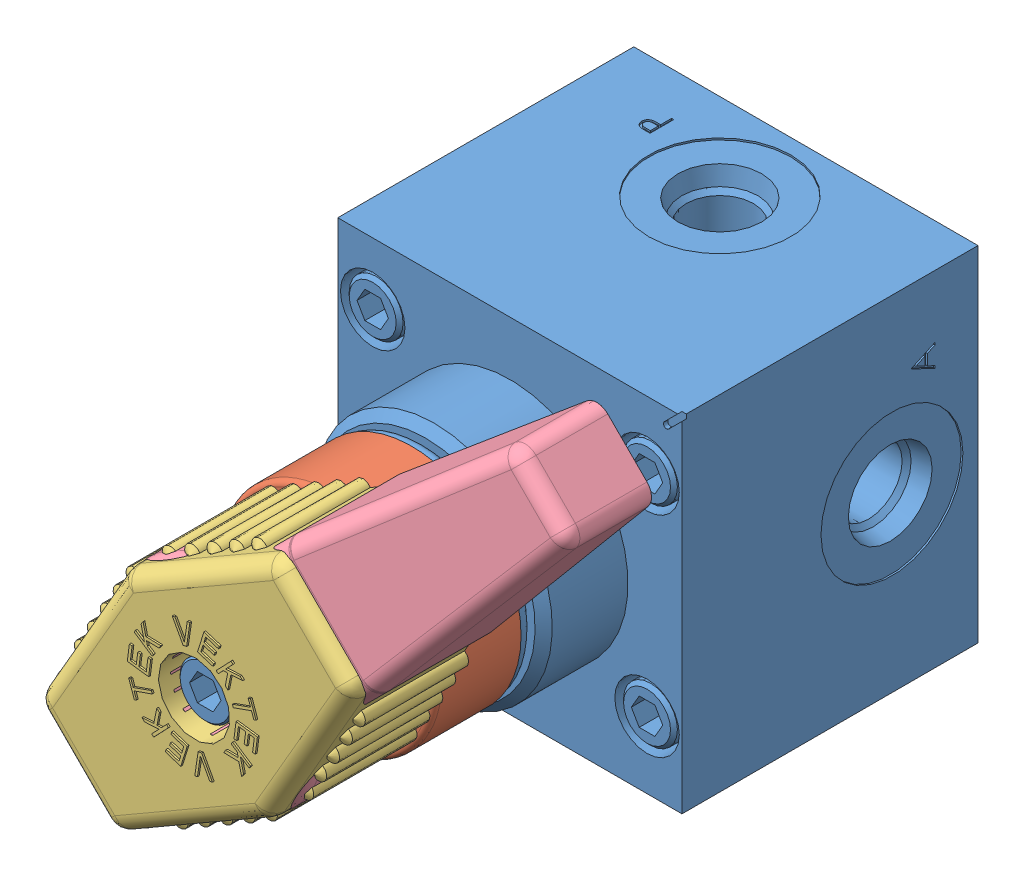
SolidWorks assembly ILC71347201.SLDASM, configuration Default (file format 5000). Lengths in mm.
Overall size (84.85 84.85 89).
4 component instances, 4 part files, 9 mates.
Components (placement in the parent):
- ILC71347201_BODY-1: ILC71347201_BODY.sldprt [Default] at (5.9037 -36.9128 -26.2135) size (50.8 50.8 88.65)
- ILC71347201_ADAPTER-1: ILC71347201_ADAPTER.sldprt [Default] at (-19.4963 -11.5128 53.1615) x (0 0 -1) z (1 0 0) size (22.23 32.26 32.26)
- 85600903-1: 85600903.sldprt [Default] at (-19.4963 -11.5128 64.0835) x (-0.707107 -0.707107 0) z (-0.707107 0.707107 0) size (51.61 19.62 30.64) (hidden)
- 85600902-1: 85600902.SLDPRT [Default] at (-19.4963 -11.5128 45.0335) x (0 0 1) z (0.707107 -0.707107 0) size (17.76 89.76 30.23)
Mates (geometry in assembly coordinates):
- Concentric1: concentric anti-aligned: cylinder of ILC71347201_BODY-1 through (-19.4963 -11.5128 63.1501) axis (0 0 -1) radius 3.9624; cylinder of ILC71347201_ADAPTER-1 through (-19.4963 -11.5128 24.857) axis (0 0 1) radius 6.35
- Coincident1: coincident anti-aligned: plane of ILC71347201_BODY-1 through (-19.4963 -11.5128 30.9365) normal (0 0 1); plane of ILC71347201_ADAPTER-1 through (-19.4963 -11.5128 30.9365) normal (0 0 -1)
- Parallel1: parallel aligned: plane of ILC71347201_BODY-1 through (3.9352 11.2837 17.4745) normal (-0.707107 0.707107 0); plane of ILC71347201_ADAPTER-1 through (-30.4945 -6.9572 53.1615) normal (-0.707107 0.707107 0)
- Concentric2: concentric anti-aligned: cylinder of ILC71347201_BODY-1 through (-19.4963 -11.5128 63.1501) axis (0 0 -1) radius 3.9624; circle of 85600903-1
- Parallel2: parallel anti-aligned: plane of ILC71347201_ADAPTER-1 through (-30.4945 -6.9572 53.1615) normal (-0.707107 0.707107 0); plane of 85600903-1 through (-30.6723 -6.8836 45.0335) normal (0.707107 -0.707107 0)
- Coincident4: coincident anti-aligned: plane of ILC71347201_ADAPTER-1 through (-19.4963 -11.5128 53.1615) normal (0 0 1); plane of 85600903-1 through (-19.4963 -11.5128 53.1615) normal (0 0 -1)
- Concentric3: concentric anti-aligned: cylinder of ILC71347201_BODY-1 through (-19.4963 -11.5128 63.1501) axis (0 0 -1) radius 3.9624; cylinder of 85600902-1 through (-19.4963 -11.5128 48.9705) axis (0 0 1) radius 5.2705
- Parallel3: parallel anti-aligned: plane of ILC71347201_ADAPTER-1 through (-30.4945 -6.9572 53.1615) normal (-0.707107 0.707107 0); plane of 85600902-1 through (-30.6723 -6.8836 45.0335) normal (0.707107 -0.707107 0)
- Coincident6: coincident anti-aligned: plane of ILC71347201_ADAPTER-1 through (-19.4963 -11.5128 53.1615) normal (0 0 1); plane of 85600902-1 through (-19.4963 -11.5128 53.1615) normal (0 0 -1)
